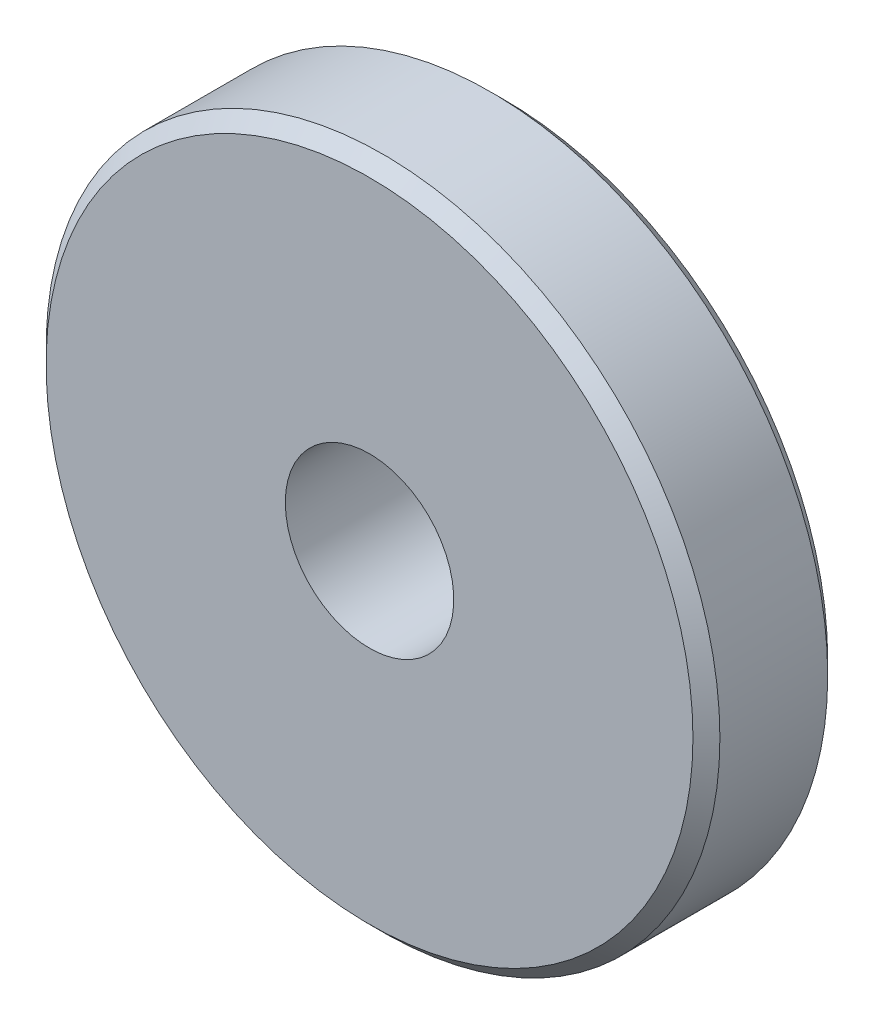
ISO-10303-21;
HEADER;
FILE_DESCRIPTION(('STEP AP214'),'2;1');
FILE_NAME('part.step','',(''),(''),'','','');
FILE_SCHEMA(('AUTOMOTIVE_DESIGN { 1 0 10303 214 1 1 1 1 }'));
ENDSEC;
DATA;
#1=APPLICATION_CONTEXT('core data for automotive mechanical design processes');
#2=APPLICATION_PROTOCOL_DEFINITION('international standard','automotive_design',2000,#1);
#3=PRODUCT_CONTEXT('',#1,'mechanical');
#4=PRODUCT('Part','Part','',(#3));
#5=PRODUCT_RELATED_PRODUCT_CATEGORY('part','',(#4));
#6=PRODUCT_DEFINITION_FORMATION('','',#4);
#7=PRODUCT_DEFINITION_CONTEXT('part definition',#1,'design');
#8=PRODUCT_DEFINITION('design','',#6,#7);
#9=PRODUCT_DEFINITION_SHAPE('','',#8);
#10=(LENGTH_UNIT() NAMED_UNIT(*) SI_UNIT(.MILLI.,.METRE.));
#11=(NAMED_UNIT(*) PLANE_ANGLE_UNIT() SI_UNIT($,.RADIAN.));
#12=(NAMED_UNIT(*) SI_UNIT($,.STERADIAN.) SOLID_ANGLE_UNIT());
#13=UNCERTAINTY_MEASURE_WITH_UNIT(LENGTH_MEASURE(1.E-05),#10,'distance_accuracy_value','');
#14=(GEOMETRIC_REPRESENTATION_CONTEXT(3) GLOBAL_UNCERTAINTY_ASSIGNED_CONTEXT((#13)) GLOBAL_UNIT_ASSIGNED_CONTEXT((#10,
#11,#12)) REPRESENTATION_CONTEXT('',''));
#15=CARTESIAN_POINT('',(0.,0.,0.));
#16=DIRECTION('',(0.,0.,1.));
#17=DIRECTION('',(1.,0.,0.));
#18=AXIS2_PLACEMENT_3D('',#15,#16,#17);
#19=CARTESIAN_POINT('',(0.,0.,1.));
#20=DIRECTION('',(0.,0.,-1.));
#21=DIRECTION('',(-1.,0.,0.));
#22=AXIS2_PLACEMENT_3D('',#19,#20,#21);
#23=CYLINDRICAL_SURFACE('',#22,5.);
#24=CARTESIAN_POINT('',(0.,0.,0.51));
#25=DIRECTION('',(0.,0.,1.));
#26=DIRECTION('',(1.,0.,0.));
#27=AXIS2_PLACEMENT_3D('',#24,#25,#26);
#28=CIRCLE('',#27,5.);
#29=CARTESIAN_POINT('',(5.,0.,0.51));
#30=VERTEX_POINT('',#29);
#31=EDGE_CURVE('E8',#30,#30,#28,.F.);
#32=ORIENTED_EDGE('',*,*,#31,.T.);
#33=EDGE_LOOP('',(#32));
#34=FACE_BOUND('',#33,.T.);
#35=CARTESIAN_POINT('',(0.,0.,0.));
#36=DIRECTION('',(0.,0.,1.));
#37=DIRECTION('',(1.,0.,0.));
#38=AXIS2_PLACEMENT_3D('',#35,#36,#37);
#39=CIRCLE('',#38,5.);
#40=CARTESIAN_POINT('',(5.,0.,0.));
#41=VERTEX_POINT('',#40);
#42=EDGE_CURVE('E38',#41,#41,#39,.T.);
#43=ORIENTED_EDGE('',*,*,#42,.T.);
#44=EDGE_LOOP('',(#43));
#45=FACE_BOUND('',#44,.T.);
#46=ADVANCED_FACE('F12',(#34,#45),#23,.T.);
#47=CARTESIAN_POINT('',(0.,0.,0.));
#48=DIRECTION('',(0.,0.,1.));
#49=DIRECTION('',(1.,0.,0.));
#50=AXIS2_PLACEMENT_3D('',#47,#48,#49);
#51=PLANE('',#50);
#52=CARTESIAN_POINT('',(0.,0.,0.));
#53=DIRECTION('',(0.,0.,-1.));
#54=DIRECTION('',(-1.,0.,0.));
#55=AXIS2_PLACEMENT_3D('',#52,#53,#54);
#56=CIRCLE('',#55,2.5);
#57=CARTESIAN_POINT('',(-2.5,0.,0.));
#58=VERTEX_POINT('',#57);
#59=EDGE_CURVE('E42',#58,#58,#56,.T.);
#60=ORIENTED_EDGE('',*,*,#59,.F.);
#61=EDGE_LOOP('',(#60));
#62=FACE_BOUND('',#61,.T.);
#63=ORIENTED_EDGE('',*,*,#42,.F.);
#64=EDGE_LOOP('',(#63));
#65=FACE_BOUND('',#64,.T.);
#66=ADVANCED_FACE('F57',(#62,#65),#51,.F.);
#67=CARTESIAN_POINT('',(0.,0.,1.));
#68=DIRECTION('',(0.,0.,1.));
#69=DIRECTION('',(1.,0.,0.));
#70=AXIS2_PLACEMENT_3D('',#67,#68,#69);
#71=PLANE('',#70);
#72=CARTESIAN_POINT('',(0.,0.,1.));
#73=DIRECTION('',(0.,0.,1.));
#74=DIRECTION('',(1.,0.,0.));
#75=AXIS2_PLACEMENT_3D('',#72,#73,#74);
#76=CIRCLE('',#75,5.49);
#77=CARTESIAN_POINT('',(5.49,0.,1.));
#78=VERTEX_POINT('',#77);
#79=EDGE_CURVE('E19',#78,#78,#76,.T.);
#80=ORIENTED_EDGE('',*,*,#79,.T.);
#81=EDGE_LOOP('',(#80));
#82=FACE_BOUND('',#81,.T.);
#83=CARTESIAN_POINT('',(0.,0.,1.));
#84=DIRECTION('',(0.,0.,1.));
#85=DIRECTION('',(1.,0.,0.));
#86=AXIS2_PLACEMENT_3D('',#83,#84,#85);
#87=CIRCLE('',#86,9.6);
#88=CARTESIAN_POINT('',(9.6,0.,1.));
#89=VERTEX_POINT('',#88);
#90=EDGE_CURVE('E27',#89,#89,#87,.F.);
#91=ORIENTED_EDGE('',*,*,#90,.T.);
#92=EDGE_LOOP('',(#91));
#93=FACE_BOUND('',#92,.T.);
#94=ADVANCED_FACE('F60',(#82,#93),#71,.F.);
#95=CARTESIAN_POINT('',(0.,0.,5.));
#96=DIRECTION('',(0.,0.,-1.));
#97=DIRECTION('',(-1.,0.,0.));
#98=AXIS2_PLACEMENT_3D('',#95,#96,#97);
#99=CYLINDRICAL_SURFACE('',#98,10.);
#100=CARTESIAN_POINT('',(0.,0.,1.4));
#101=DIRECTION('',(0.,0.,1.));
#102=DIRECTION('',(1.,0.,0.));
#103=AXIS2_PLACEMENT_3D('',#100,#101,#102);
#104=CIRCLE('',#103,10.);
#105=CARTESIAN_POINT('',(10.,0.,1.4));
#106=VERTEX_POINT('',#105);
#107=EDGE_CURVE('E32',#106,#106,#104,.T.);
#108=ORIENTED_EDGE('',*,*,#107,.T.);
#109=EDGE_LOOP('',(#108));
#110=FACE_BOUND('',#109,.T.);
#111=CARTESIAN_POINT('',(0.,0.,4.6));
#112=DIRECTION('',(0.,0.,1.));
#113=DIRECTION('',(1.,0.,0.));
#114=AXIS2_PLACEMENT_3D('',#111,#112,#113);
#115=CIRCLE('',#114,10.);
#116=CARTESIAN_POINT('',(10.,0.,4.6));
#117=VERTEX_POINT('',#116);
#118=EDGE_CURVE('E35',#117,#117,#115,.F.);
#119=ORIENTED_EDGE('',*,*,#118,.T.);
#120=EDGE_LOOP('',(#119));
#121=FACE_BOUND('',#120,.T.);
#122=ADVANCED_FACE('F87',(#110,#121),#99,.T.);
#123=CARTESIAN_POINT('',(0.,0.,5.));
#124=DIRECTION('',(0.,0.,1.));
#125=DIRECTION('',(1.,0.,0.));
#126=AXIS2_PLACEMENT_3D('',#123,#124,#125);
#127=PLANE('',#126);
#128=CARTESIAN_POINT('',(0.,0.,5.));
#129=DIRECTION('',(0.,0.,1.));
#130=DIRECTION('',(1.,0.,0.));
#131=AXIS2_PLACEMENT_3D('',#128,#129,#130);
#132=CIRCLE('',#131,9.6);
#133=CARTESIAN_POINT('',(9.6,0.,5.));
#134=VERTEX_POINT('',#133);
#135=EDGE_CURVE('E23',#134,#134,#132,.T.);
#136=ORIENTED_EDGE('',*,*,#135,.T.);
#137=EDGE_LOOP('',(#136));
#138=FACE_BOUND('',#137,.T.);
#139=CARTESIAN_POINT('',(0.,0.,5.));
#140=DIRECTION('',(0.,0.,-1.));
#141=DIRECTION('',(-1.,0.,0.));
#142=AXIS2_PLACEMENT_3D('',#139,#140,#141);
#143=CIRCLE('',#142,2.5);
#144=CARTESIAN_POINT('',(-2.5,0.,5.));
#145=VERTEX_POINT('',#144);
#146=EDGE_CURVE('E41',#145,#145,#143,.T.);
#147=ORIENTED_EDGE('',*,*,#146,.T.);
#148=EDGE_LOOP('',(#147));
#149=FACE_BOUND('',#148,.T.);
#150=ADVANCED_FACE('F48',(#138,#149),#127,.T.);
#151=CARTESIAN_POINT('',(0.,0.,5.));
#152=DIRECTION('',(0.,0.,-1.));
#153=DIRECTION('',(-1.,0.,0.));
#154=AXIS2_PLACEMENT_3D('',#151,#152,#153);
#155=CYLINDRICAL_SURFACE('',#154,2.5);
#156=ORIENTED_EDGE('',*,*,#146,.F.);
#157=EDGE_LOOP('',(#156));
#158=FACE_BOUND('',#157,.T.);
#159=ORIENTED_EDGE('',*,*,#59,.T.);
#160=EDGE_LOOP('',(#159));
#161=FACE_BOUND('',#160,.T.);
#162=ADVANCED_FACE('F50',(#158,#161),#155,.F.);
#163=CARTESIAN_POINT('',(0.,0.,1.4));
#164=DIRECTION('',(0.,0.,1.));
#165=DIRECTION('',(1.,0.,0.));
#166=AXIS2_PLACEMENT_3D('',#163,#164,#165);
#167=CONICAL_SURFACE('',#166,10.,0.785398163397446);
#168=ORIENTED_EDGE('',*,*,#90,.F.);
#169=EDGE_LOOP('',(#168));
#170=FACE_BOUND('',#169,.T.);
#171=ORIENTED_EDGE('',*,*,#107,.F.);
#172=EDGE_LOOP('',(#171));
#173=FACE_BOUND('',#172,.T.);
#174=ADVANCED_FACE('F53',(#170,#173),#167,.T.);
#175=CARTESIAN_POINT('',(0.,0.,5.));
#176=DIRECTION('',(0.,0.,-1.));
#177=DIRECTION('',(-1.,0.,0.));
#178=AXIS2_PLACEMENT_3D('',#175,#176,#177);
#179=CONICAL_SURFACE('',#178,9.6,0.785398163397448);
#180=ORIENTED_EDGE('',*,*,#118,.F.);
#181=EDGE_LOOP('',(#180));
#182=FACE_BOUND('',#181,.T.);
#183=ORIENTED_EDGE('',*,*,#135,.F.);
#184=EDGE_LOOP('',(#183));
#185=FACE_BOUND('',#184,.T.);
#186=ADVANCED_FACE('F73',(#182,#185),#179,.T.);
#187=CARTESIAN_POINT('',(0.,0.,0.51));
#188=DIRECTION('',(0.,0.,1.));
#189=DIRECTION('',(1.,0.,0.));
#190=AXIS2_PLACEMENT_3D('',#187,#188,#189);
#191=TOROIDAL_SURFACE('',#190,5.49,0.49);
#192=ORIENTED_EDGE('',*,*,#31,.F.);
#193=EDGE_LOOP('',(#192));
#194=FACE_BOUND('',#193,.T.);
#195=ORIENTED_EDGE('',*,*,#79,.F.);
#196=EDGE_LOOP('',(#195));
#197=FACE_BOUND('',#196,.T.);
#198=ADVANCED_FACE('F14',(#194,#197),#191,.F.);
#199=CLOSED_SHELL('',(#46,#66,#94,#122,#150,#162,#174,#186,#198));
#200=MANIFOLD_SOLID_BREP('B1',#199);
#201=ADVANCED_BREP_SHAPE_REPRESENTATION('',(#18,#200),#14);
#202=SHAPE_DEFINITION_REPRESENTATION(#9,#201);
ENDSEC;
END-ISO-10303-21;
